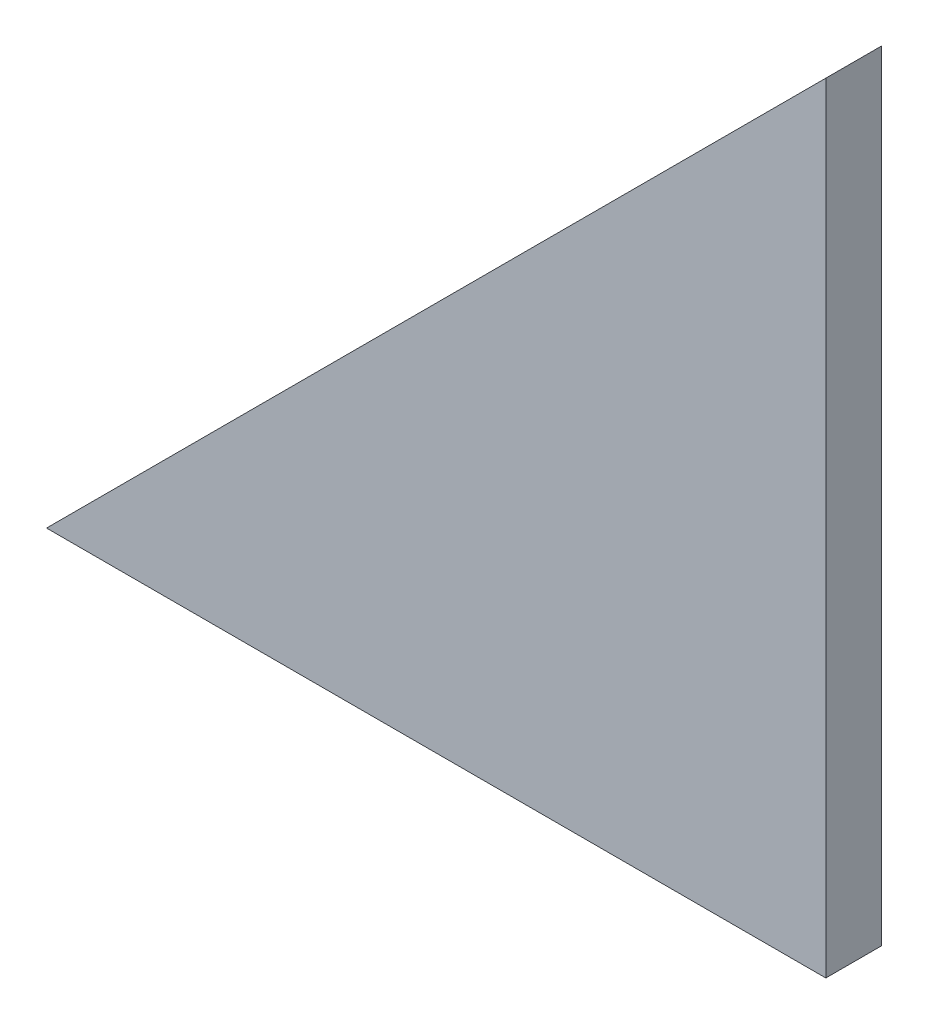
from build123d import *

# Parameters (mm, degrees)
EXTRUDE1_DEPTH = 6.35


with BuildPart() as part:
    # Sketch1 → Extrude1 (new body)
    with BuildSketch(Plane.XY):
        Polygon((0, 0), (88.9, 0), (88.9, 88.9), align=None)
    extrude(amount=EXTRUDE1_DEPTH)


solid = part.part
